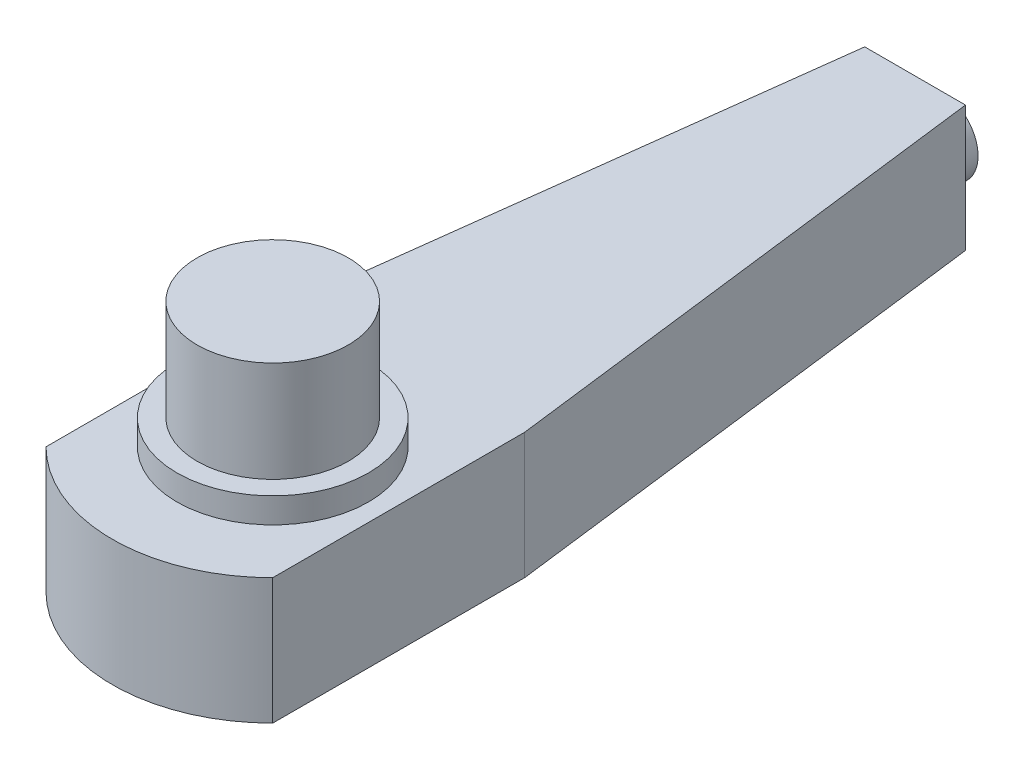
from build123d import *

# Parameters (mm, degrees)
SALIENTE_EXTRUIR1_DEPTH = 25
CROQUIS2_R              = 19
SALIENTE_EXTRUIR2_DEPTH = 5
CROQUIS3_R              = 15
SALIENTE_EXTRUIR3_DEPTH = 20
CROQUIS4_R              = 7.5
SALIENTE_EXTRUIR4_DEPTH = 5


with BuildPart() as part:
    # Croquis1 → Saliente-Extruir1 (new body)
    with BuildSketch(Plane(origin=(0, 0, 0), x_dir=(1, 0, 0), z_dir=(0, 1, 0))):
        with BuildLine():
            Line((-22.5, -75), (-22.5, -25))
            Line((-22.5, -25), (-10, 75))
            Line((-10, 75), (10, 75))
            Line((10, 75), (22.5, -25))
            Line((22.5, -25), (22.5, -75))
            ThreePointArc((22.5, -75), (0, -84.319805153), (-22.5, -75))
        make_face()
    extrude(amount=SALIENTE_EXTRUIR1_DEPTH)

    # Croquis2 → Saliente-Extruir2 (add)
    with BuildSketch(Plane(origin=(0, 25, 0), x_dir=(1, 0, 0), z_dir=(0, 1, 0))):
        with Locations(Location((0, -52.5, 0), (0, 0, 90))):
            Circle(CROQUIS2_R)
    extrude(amount=SALIENTE_EXTRUIR2_DEPTH)

    # Croquis3 → Saliente-Extruir3 (add)
    with BuildSketch(Plane(origin=(0, 30, 0), x_dir=(1, 0, 0), z_dir=(0, 1, 0))):
        with Locations(Location((0, -52.5, 0), (0, 0, 270))):
            Circle(CROQUIS3_R)
    extrude(amount=SALIENTE_EXTRUIR3_DEPTH)

    # Croquis4 → Saliente-Extruir4 (add)
    with BuildSketch(Plane(origin=(0, 0, -75), x_dir=(-1, 0, 0), z_dir=(0, 0, -1))):
        with Locations((0, 12.5)):
            Circle(CROQUIS4_R)
    extrude(amount=SALIENTE_EXTRUIR4_DEPTH)


solid = part.part
